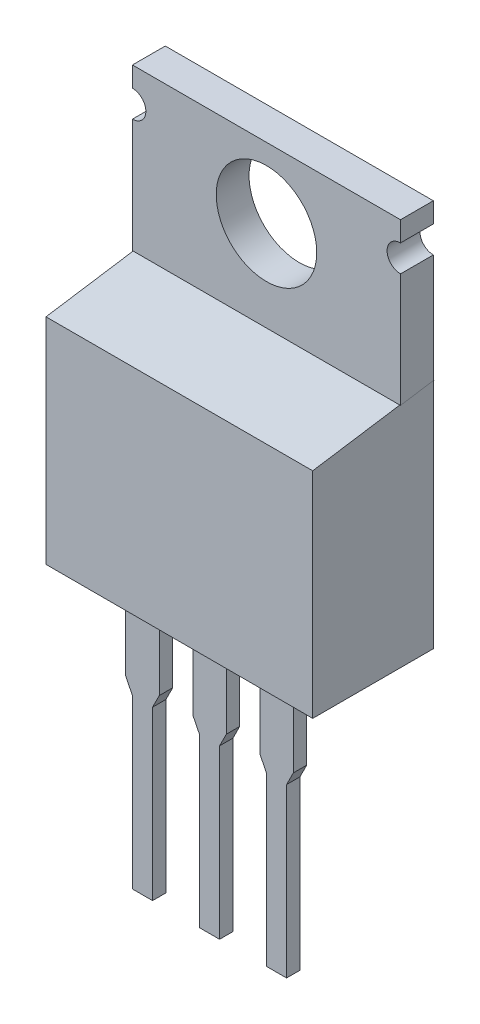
from build123d import *

# Parameters (mm, degrees)
SKETCH2_W                = 10.16
SKETCH2_H                = 4.572
BASE_EXTRUDE_DEPTH       = 14.732
CUT_EXTRUDE1_DEPTH       = 22.380177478
CUT_EXTRUDE1_DEPTH_BACK  = 22.380177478
SKETCH4_R                = 1.905
CUT_EXTRUDE2_DEPTH       = 14.732
CUT_EXTRUDE4_DEPTH       = 0.0254
CUT_EXTRUDE5_DEPTH       = 0.0254
CUT_EXTRUDE6_DEPTH       = 0.0254
CUT_EXTRUDE7_DEPTH       = 2.54
SKETCH9_W                = 1.27
SKETCH9_H                = 10.16
BOSS_EXTRUDE_THIN1_DEPTH = 0.254
CUT_EXTRUDE8_DEPTH       = 1.27
LPATTERN1_COUNT          = 3
LPATTERN1_PITCH          = 2.54


with BuildPart() as part:
    # Sketch2 → Base-Extrude (new body)
    with BuildSketch(Plane(origin=(0, 3.81, 0), x_dir=(-1, 0, 0), z_dir=(0, 1, 0))):
        with Locations((-2.54, -0.889)):
            Rectangle(SKETCH2_W, SKETCH2_H)
    extrude(amount=BASE_EXTRUDE_DEPTH)

    # Sketch3 → Cut-Extrude1 (cut, two sides: drawn at the far end of the back side and taken through both)
    with BuildSketch(Plane.ZY.offset(2.54).offset(-CUT_EXTRUDE1_DEPTH_BACK)):
        Polygon((-1.905, 18.542), (-1.905, 12.446), (1.397, 11.938), (1.397, 18.542), align=None)
    extrude(amount=CUT_EXTRUDE1_DEPTH + CUT_EXTRUDE1_DEPTH_BACK, mode=Mode.SUBTRACT)

    # Sketch4 → Cut-Extrude2 (cut)
    with BuildSketch(Plane.XY.offset(-1.905)):
        with Locations((2.54, 15.875)):
            Circle(SKETCH4_R)
    extrude(amount=-CUT_EXTRUDE2_DEPTH, mode=Mode.SUBTRACT)

    # Sketch5 → Cut-Extrude4 (cut)
    with BuildSketch(Plane.ZY.offset(2.54)):
        Polygon((-3.175, 12.641384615), (1.397, 11.938), (1.397, 3.81), (-3.175, 3.81), align=None)
    extrude(amount=-CUT_EXTRUDE4_DEPTH, mode=Mode.SUBTRACT)

    # Sketch6 → Cut-Extrude5 (cut)
    with BuildSketch(Plane(origin=(7.62, 0, 0), x_dir=(0, 0, -1), z_dir=(1, 0, 0))):
        Polygon((-1.397, 11.938), (3.175, 12.641384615), (3.175, 3.81), (-1.397, 3.81), align=None)
    extrude(amount=-CUT_EXTRUDE5_DEPTH, mode=Mode.SUBTRACT)

    # Sketch7 → Cut-Extrude6 (cut)
    with BuildSketch(Plane(origin=(0, 0, -3.175), x_dir=(-1, 0, 0), z_dir=(0, 0, -1))):
        Polygon((-7.62, 18.542), (-7.62, 12.641384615), (-6.35, 12.641384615), (-6.35, 7.112), (1.27, 7.112), (1.27, 12.641384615), (2.54, 12.641384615), (2.54, 18.542), align=None)
    extrude(amount=-CUT_EXTRUDE6_DEPTH, mode=Mode.SUBTRACT)

    # Sketch8 → Cut-Extrude7 (cut)
    with BuildSketch(Plane.XY.offset(-1.905)):
        with BuildLine():
            Line((7.62, 16.764), (7.62, 17.78))
            ThreePointArc((7.62, 17.78), (7.112, 17.272), (7.62, 16.764))
        make_face()
        with BuildLine():
            Line((-2.54, 16.764), (-2.54, 17.78))
            ThreePointArc((-2.54, 17.78), (-2.032, 17.272), (-2.54, 16.764))
        make_face()
    extrude(amount=-CUT_EXTRUDE7_DEPTH, mode=Mode.SUBTRACT)

    # Sketch9 → Boss-Extrude-Thin1 (add, symmetric)
    with BuildSketch(Plane.XY):
        with Locations((0, -1.27)):
            Rectangle(SKETCH9_W, SKETCH9_H)
    boss_extrude_thin1 = extrude(amount=BOSS_EXTRUDE_THIN1_DEPTH, both=True)

    # Sketch11 → Cut-Extrude8 (cut)
    with BuildSketch(Plane.XY.offset(0.254)):
        Polygon((0.635, 0.508), (0.635, -6.35), (0.381, -6.35), (0.381, 0), align=None)
        Polygon((-0.635, 0.508), (-0.635, -6.35), (-0.381, -6.35), (-0.381, 0), align=None)
    cut_extrude8 = extrude(amount=-CUT_EXTRUDE8_DEPTH, mode=Mode.SUBTRACT)

    # LPattern1: Boss-Extrude-Thin1, Cut-Extrude8 ×3
    with Locations(*[(i * LPATTERN1_PITCH, 0, 0) for i in range(1, LPATTERN1_COUNT)]):
        add(boss_extrude_thin1)
        add(cut_extrude8, mode=Mode.SUBTRACT)


solid = part.part
